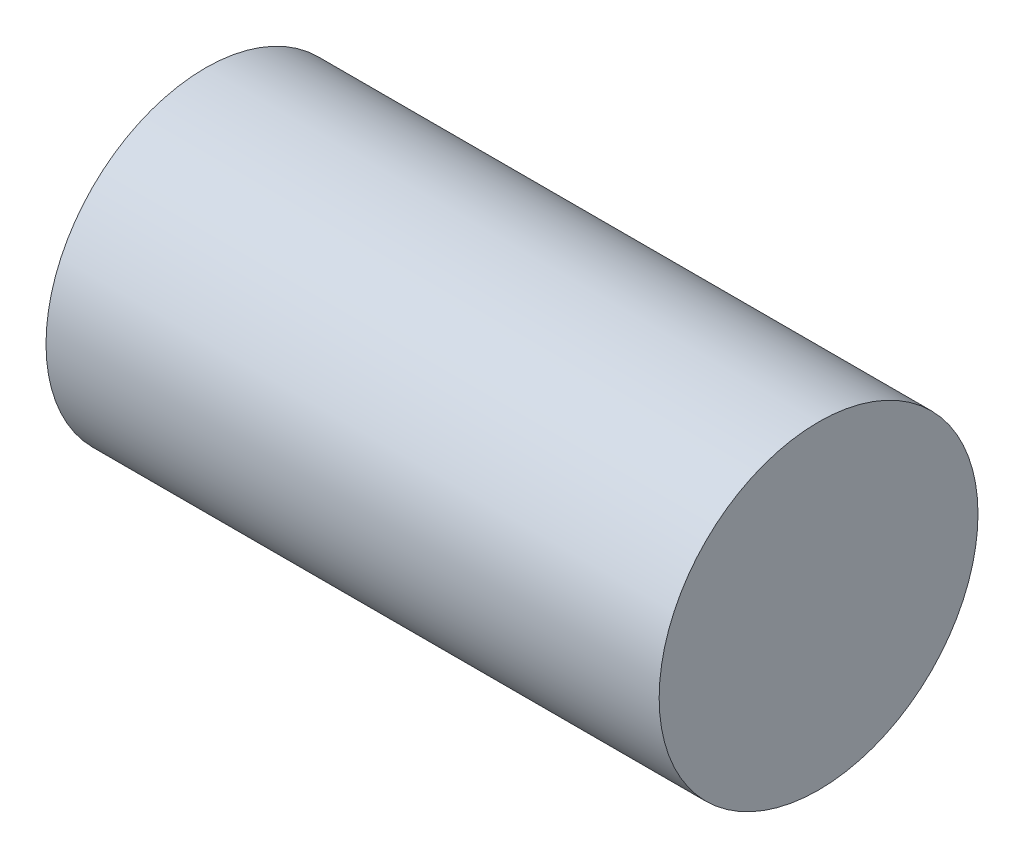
ISO-10303-21;
HEADER;
FILE_DESCRIPTION(('STEP AP214'),'2;1');
FILE_NAME('part.step','',(''),(''),'','','');
FILE_SCHEMA(('AUTOMOTIVE_DESIGN { 1 0 10303 214 1 1 1 1 }'));
ENDSEC;
DATA;
#1=APPLICATION_CONTEXT('core data for automotive mechanical design processes');
#2=APPLICATION_PROTOCOL_DEFINITION('international standard','automotive_design',2000,#1);
#3=PRODUCT_CONTEXT('',#1,'mechanical');
#4=PRODUCT('Part','Part','',(#3));
#5=PRODUCT_RELATED_PRODUCT_CATEGORY('part','',(#4));
#6=PRODUCT_DEFINITION_FORMATION('','',#4);
#7=PRODUCT_DEFINITION_CONTEXT('part definition',#1,'design');
#8=PRODUCT_DEFINITION('design','',#6,#7);
#9=PRODUCT_DEFINITION_SHAPE('','',#8);
#10=(LENGTH_UNIT() NAMED_UNIT(*) SI_UNIT(.MILLI.,.METRE.));
#11=(NAMED_UNIT(*) PLANE_ANGLE_UNIT() SI_UNIT($,.RADIAN.));
#12=(NAMED_UNIT(*) SI_UNIT($,.STERADIAN.) SOLID_ANGLE_UNIT());
#13=UNCERTAINTY_MEASURE_WITH_UNIT(LENGTH_MEASURE(1.E-05),#10,'distance_accuracy_value','');
#14=(GEOMETRIC_REPRESENTATION_CONTEXT(3) GLOBAL_UNCERTAINTY_ASSIGNED_CONTEXT((#13)) GLOBAL_UNIT_ASSIGNED_CONTEXT((#10,
#11,#12)) REPRESENTATION_CONTEXT('',''));
#15=CARTESIAN_POINT('',(0.,0.,0.));
#16=DIRECTION('',(0.,0.,1.));
#17=DIRECTION('',(1.,0.,0.));
#18=AXIS2_PLACEMENT_3D('',#15,#16,#17);
#19=CARTESIAN_POINT('',(1.51,0.,1.5));
#20=DIRECTION('',(1.,0.,0.));
#21=DIRECTION('',(0.,0.,-1.));
#22=AXIS2_PLACEMENT_3D('',#19,#20,#21);
#23=PLANE('',#22);
#24=CARTESIAN_POINT('',(1.51,0.,1.5));
#25=DIRECTION('',(1.,0.,0.));
#26=DIRECTION('',(0.,0.,-1.));
#27=AXIS2_PLACEMENT_3D('',#24,#25,#26);
#28=CIRCLE('',#27,0.259999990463);
#29=CARTESIAN_POINT('',(1.51,0.,1.240000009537));
#30=VERTEX_POINT('',#29);
#31=EDGE_CURVE('E18',#30,#30,#28,.F.);
#32=ORIENTED_EDGE('',*,*,#31,.F.);
#33=EDGE_LOOP('',(#32));
#34=FACE_BOUND('',#33,.T.);
#35=ADVANCED_FACE('F15',(#34),#23,.T.);
#36=CARTESIAN_POINT('',(0.51,0.,1.5));
#37=DIRECTION('',(1.,0.,0.));
#38=DIRECTION('',(0.,0.,-1.));
#39=AXIS2_PLACEMENT_3D('',#36,#37,#38);
#40=PLANE('',#39);
#41=CARTESIAN_POINT('',(0.51,0.,1.5));
#42=DIRECTION('',(1.,0.,0.));
#43=DIRECTION('',(0.,0.,-1.));
#44=AXIS2_PLACEMENT_3D('',#41,#42,#43);
#45=CIRCLE('',#44,0.259999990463);
#46=CARTESIAN_POINT('',(0.51,0.,1.240000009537));
#47=VERTEX_POINT('',#46);
#48=EDGE_CURVE('E10',#47,#47,#45,.T.);
#49=ORIENTED_EDGE('',*,*,#48,.F.);
#50=EDGE_LOOP('',(#49));
#51=FACE_BOUND('',#50,.T.);
#52=ADVANCED_FACE('F30',(#51),#40,.F.);
#53=CARTESIAN_POINT('',(0.51,0.,1.5));
#54=DIRECTION('',(1.,0.,0.));
#55=DIRECTION('',(0.,0.,-1.));
#56=AXIS2_PLACEMENT_3D('',#53,#54,#55);
#57=CYLINDRICAL_SURFACE('',#56,0.259999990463);
#58=ORIENTED_EDGE('',*,*,#48,.T.);
#59=EDGE_LOOP('',(#58));
#60=FACE_BOUND('',#59,.T.);
#61=ORIENTED_EDGE('',*,*,#31,.T.);
#62=EDGE_LOOP('',(#61));
#63=FACE_BOUND('',#62,.T.);
#64=ADVANCED_FACE('F27',(#60,#63),#57,.T.);
#65=CLOSED_SHELL('',(#35,#52,#64));
#66=MANIFOLD_SOLID_BREP('B1',#65);
#67=ADVANCED_BREP_SHAPE_REPRESENTATION('',(#18,#66),#14);
#68=SHAPE_DEFINITION_REPRESENTATION(#9,#67);
ENDSEC;
END-ISO-10303-21;
